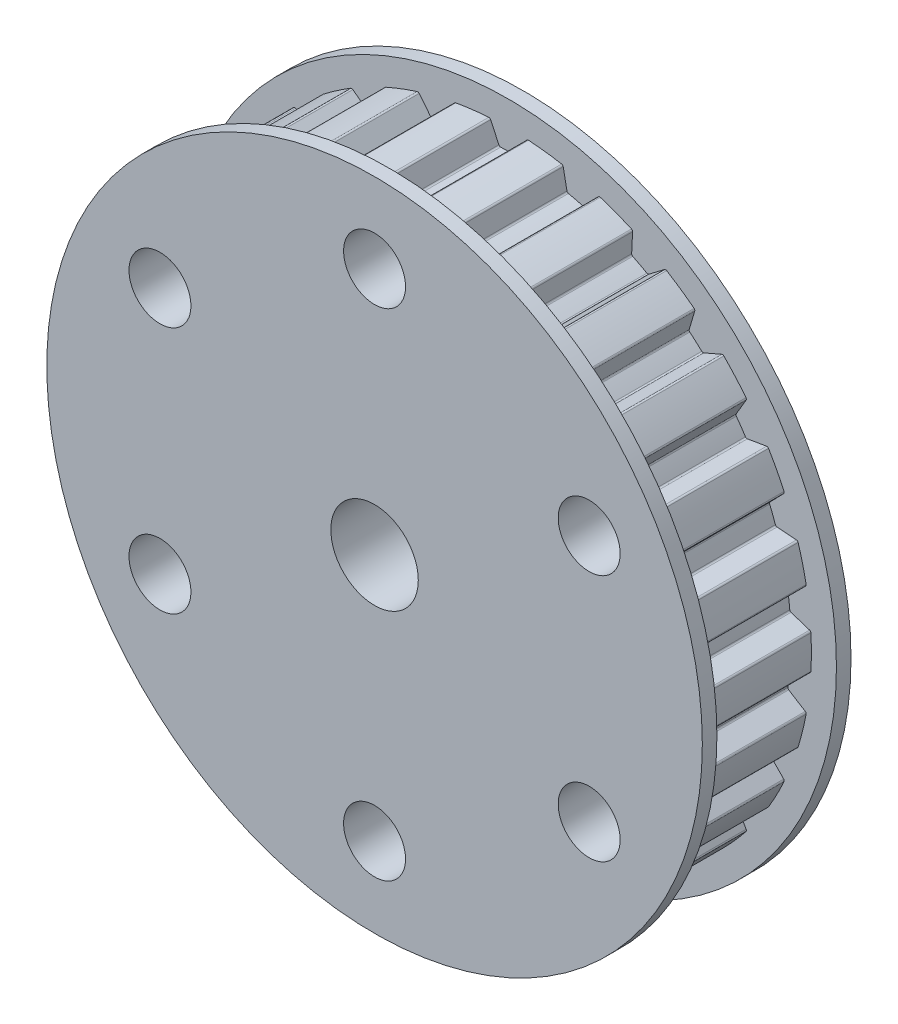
from build123d import *

# Parameters (mm, degrees)
SKETCH1_R                  = 20.765
BOSS_EXTRUDE1_DEPTH        = 8.2
CUT_EXTRUDE1_REACH         = 32.49
FILLET1_R                  = 0.13
CIRPATTERN1_COUNT          = 26
FILLET1_OF_CIRPATTERN1_R   = 0.13
CROQUIS1_R                 = 22.485
SALIENTE_EXTRUIR1_DEPTH    = 1
CORTAR_EXTRUIR1_DEPTH      = 34.102725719
CORTAR_EXTRUIR1_DEPTH_BACK = 34.102725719
CROQUIS2_R                 = 3
CORTAR_EXTRUIR2_DEPTH      = 34.102725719
CORTAR_EXTRUIR2_DEPTH_BACK = 34.102725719
CROQUIS3_R                 = 2.125


with BuildPart() as part:
    # Sketch1 → Boss-Extrude1 (new body)
    with BuildSketch(Plane.XY):
        Circle(SKETCH1_R)
    extrude(amount=BOSS_EXTRUDE1_DEPTH)

    # Sketch2 → Cut-Extrude1 (cut, up to next)
    with BuildSketch(Plane.XY.offset(8.2), mode=Mode.PRIVATE) as cut_extrude1_sk1:
        with BuildLine():
            Line((-1.274433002, 20.725854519), (-0.671193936, 19.432204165))
            ThreePointArc((-0.671193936, 19.432204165), (-0.621659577, 19.376523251), (-0.549683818, 19.357196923))
            ThreePointArc((-0.549683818, 19.357196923), (0, 19.365), (0.549683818, 19.357196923))
            ThreePointArc((0.549683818, 19.357196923), (0.621659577, 19.376523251), (0.671193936, 19.432204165))
            Line((0.671193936, 19.432204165), (1.274433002, 20.725854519))
            ThreePointArc((1.274433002, 20.725854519), (0, 20.765), (-1.274433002, 20.725854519))
        make_face()
    cut_extrude1_tool1 = extrude(cut_extrude1_sk1.sketch, amount=-CUT_EXTRUDE1_REACH, mode=Mode.PRIVATE) & part.part
    cut_extrude1 = cut_extrude1_tool1.solids().sort_by_distance((0, 20.13552, 8.2))[0]
    add(cut_extrude1, mode=Mode.SUBTRACT)

    # Fillet1
    fillet1_edges = [part.edges().sort_by_distance(p)[0] for p in [
        (-1.274433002, 20.725854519, 4.1),
        (1.274433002, 20.725854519, 4.1),
    ]]
    fillet(fillet1_edges, radius=FILLET1_R)

    # CirPattern1: Cut-Extrude1 ×26 about axis
    cirpattern1_axis = Axis((0, 0, 0), (0, 0, 1))
    for i in range(1, CIRPATTERN1_COUNT):
        add(cut_extrude1.rotate(cirpattern1_axis, i * 360 / CIRPATTERN1_COUNT), mode=Mode.SUBTRACT)

    # Fillet1 of CirPattern1
    fillet1_of_cirpattern1_edges = [part.edges().sort_by_distance(p)[0] for p in [
        (-6.197421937, 19.818607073, 4.1),
        (-3.722621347, 20.428590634, 4.1),
        (-10.760239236, 17.759574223, 4.1),
        (-8.503330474, 18.944091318, 4.1),
        (-14.697710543, 14.668419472, 4.1),
        (-12.789856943, 16.358630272, 4.1),
        (-17.781004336, 10.724789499, 4.1),
        (-16.333083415, 12.822465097, 4.1),
        (-19.830930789, 6.157873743, 4.1),
        (-18.927090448, 8.541104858, 4.1),
        (-20.728355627, 1.233084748, 4.1),
        (-20.42112378, 3.76336665, 4.1),
        (-20.42112378, -3.76336665, 4.1),
        (-20.728355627, -1.233084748, 4.1),
        (-18.927090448, -8.541104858, 4.1),
        (-19.830930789, -6.157873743, 4.1),
        (-16.333083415, -12.822465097, 4.1),
        (-17.781004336, -10.724789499, 4.1),
        (-12.789856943, -16.358630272, 4.1),
        (-14.697710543, -14.668419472, 4.1),
        (-8.503330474, -18.944091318, 4.1),
        (-10.760239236, -17.759574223, 4.1),
        (-3.722621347, -20.428590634, 4.1),
        (-6.197421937, -19.818607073, 4.1),
        (1.274433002, -20.725854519, 4.1),
        (-1.274433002, -20.725854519, 4.1),
        (6.197421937, -19.818607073, 4.1),
        (3.722621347, -20.428590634, 4.1),
        (10.760239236, -17.759574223, 4.1),
        (8.503330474, -18.944091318, 4.1),
        (14.697710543, -14.668419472, 4.1),
        (12.789856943, -16.358630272, 4.1),
        (17.781004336, -10.724789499, 4.1),
        (16.333083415, -12.822465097, 4.1),
        (19.830930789, -6.157873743, 4.1),
        (18.927090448, -8.541104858, 4.1),
        (20.728355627, -1.233084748, 4.1),
        (20.42112378, -3.76336665, 4.1),
        (20.42112378, 3.76336665, 4.1),
        (20.728355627, 1.233084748, 4.1),
        (18.927090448, 8.541104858, 4.1),
        (19.830930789, 6.157873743, 4.1),
        (16.333083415, 12.822465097, 4.1),
        (17.781004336, 10.724789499, 4.1),
        (12.789856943, 16.358630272, 4.1),
        (14.697710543, 14.668419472, 4.1),
        (8.503330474, 18.944091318, 4.1),
        (10.760239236, 17.759574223, 4.1),
        (3.722621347, 20.428590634, 4.1),
        (6.197421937, 19.818607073, 4.1),
    ]]
    fillet(fillet1_of_cirpattern1_edges, radius=FILLET1_OF_CIRPATTERN1_R)

    # Croquis1 → Saliente-Extruir1 (add)
    with BuildSketch(Plane.XY.offset(8.2)):
        Circle(CROQUIS1_R)
    saliente_extruir1 = extrude(amount=SALIENTE_EXTRUIR1_DEPTH)

    # Simetr_a1: Saliente-Extruir1 across plane
    add(saliente_extruir1.mirror(Plane.XY.offset(4.1)))

    # Croquis2 → Cortar-Extruir1 (cut, two sides: drawn at the far end of the back side and taken through both)
    with BuildSketch(Plane.XY.offset(-CORTAR_EXTRUIR1_DEPTH_BACK)):
        Circle(CROQUIS2_R)
    extrude(amount=CORTAR_EXTRUIR1_DEPTH + CORTAR_EXTRUIR1_DEPTH_BACK, mode=Mode.SUBTRACT)

    # Croquis3 → Cortar-Extruir2 (cut, two sides: drawn at the far end of the back side and taken through both)
    with BuildSketch(Plane.XY.offset(-CORTAR_EXTRUIR2_DEPTH_BACK)):
        with Locations((0, 17)):
            Circle(CROQUIS3_R)
        with Locations((14.722431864, 8.5)):
            Circle(CROQUIS3_R)
        with Locations((14.722431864, -8.5)):
            Circle(CROQUIS3_R)
        with Locations((0, -17)):
            Circle(CROQUIS3_R)
        with Locations((-14.722431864, -8.5)):
            Circle(CROQUIS3_R)
        with Locations((-14.722431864, 8.5)):
            Circle(CROQUIS3_R)
    extrude(amount=CORTAR_EXTRUIR2_DEPTH + CORTAR_EXTRUIR2_DEPTH_BACK, mode=Mode.SUBTRACT)


solid = part.part
